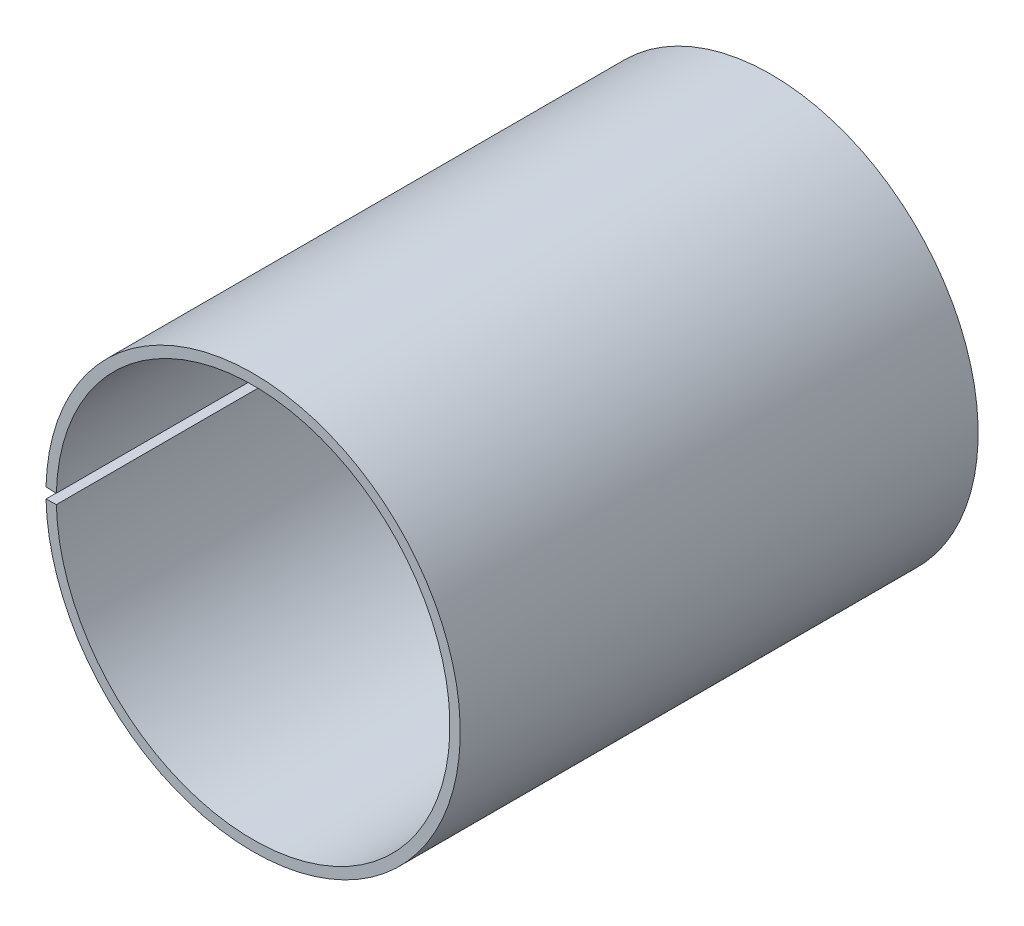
ISO-10303-21;
HEADER;
FILE_DESCRIPTION(('STEP AP214'),'2;1');
FILE_NAME('part.step','',(''),(''),'','','');
FILE_SCHEMA(('AUTOMOTIVE_DESIGN { 1 0 10303 214 1 1 1 1 }'));
ENDSEC;
DATA;
#1=APPLICATION_CONTEXT('core data for automotive mechanical design processes');
#2=APPLICATION_PROTOCOL_DEFINITION('international standard','automotive_design',2000,#1);
#3=PRODUCT_CONTEXT('',#1,'mechanical');
#4=PRODUCT('Part','Part','',(#3));
#5=PRODUCT_RELATED_PRODUCT_CATEGORY('part','',(#4));
#6=PRODUCT_DEFINITION_FORMATION('','',#4);
#7=PRODUCT_DEFINITION_CONTEXT('part definition',#1,'design');
#8=PRODUCT_DEFINITION('design','',#6,#7);
#9=PRODUCT_DEFINITION_SHAPE('','',#8);
#10=(LENGTH_UNIT() NAMED_UNIT(*) SI_UNIT(.MILLI.,.METRE.));
#11=(NAMED_UNIT(*) PLANE_ANGLE_UNIT() SI_UNIT($,.RADIAN.));
#12=(NAMED_UNIT(*) SI_UNIT($,.STERADIAN.) SOLID_ANGLE_UNIT());
#13=UNCERTAINTY_MEASURE_WITH_UNIT(LENGTH_MEASURE(1.E-05),#10,'distance_accuracy_value','');
#14=(GEOMETRIC_REPRESENTATION_CONTEXT(3) GLOBAL_UNCERTAINTY_ASSIGNED_CONTEXT((#13)) GLOBAL_UNIT_ASSIGNED_CONTEXT((#10,
#11,#12)) REPRESENTATION_CONTEXT('',''));
#15=CARTESIAN_POINT('',(0.,0.,0.));
#16=DIRECTION('',(0.,0.,1.));
#17=DIRECTION('',(1.,0.,0.));
#18=AXIS2_PLACEMENT_3D('',#15,#16,#17);
#19=CARTESIAN_POINT('',(100.,0.,-100.));
#20=DIRECTION('',(0.,0.,1.));
#21=DIRECTION('',(1.,0.,0.));
#22=AXIS2_PLACEMENT_3D('',#19,#20,#21);
#23=CYLINDRICAL_SURFACE('',#22,40.);
#24=CARTESIAN_POINT('',(100.,0.,0.));
#25=DIRECTION('',(0.,0.,1.));
#26=DIRECTION('',(1.,0.,0.));
#27=AXIS2_PLACEMENT_3D('',#24,#25,#26);
#28=CIRCLE('',#27,40.);
#29=CARTESIAN_POINT('',(60.0125019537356,-1.00000000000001,0.));
#30=VERTEX_POINT('',#29);
#31=CARTESIAN_POINT('',(60.0125019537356,1.00000000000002,0.));
#32=VERTEX_POINT('',#31);
#33=EDGE_CURVE('E100',#30,#32,#28,.T.);
#34=ORIENTED_EDGE('',*,*,#33,.F.);
#35=DIRECTION('',(0.,0.,1.));
#36=VECTOR('',#35,1.);
#37=CARTESIAN_POINT('',(60.0125019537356,-1.00000000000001,-100.));
#38=LINE('',#37,#36);
#39=CARTESIAN_POINT('',(60.0125019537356,-1.00000000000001,-100.));
#40=VERTEX_POINT('',#39);
#41=EDGE_CURVE('E11',#40,#30,#38,.T.);
#42=ORIENTED_EDGE('',*,*,#41,.F.);
#43=CARTESIAN_POINT('',(100.,0.,-100.));
#44=DIRECTION('',(0.,0.,1.));
#45=DIRECTION('',(1.,0.,0.));
#46=AXIS2_PLACEMENT_3D('',#43,#44,#45);
#47=CIRCLE('',#46,40.);
#48=CARTESIAN_POINT('',(60.0125019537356,1.00000000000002,-100.));
#49=VERTEX_POINT('',#48);
#50=EDGE_CURVE('E95',#40,#49,#47,.T.);
#51=ORIENTED_EDGE('',*,*,#50,.T.);
#52=DIRECTION('',(0.,0.,1.));
#53=VECTOR('',#52,1.);
#54=CARTESIAN_POINT('',(60.0125019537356,1.00000000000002,-100.));
#55=LINE('',#54,#53);
#56=EDGE_CURVE('E38',#49,#32,#55,.T.);
#57=ORIENTED_EDGE('',*,*,#56,.T.);
#58=EDGE_LOOP('',(#34,#42,#51,#57));
#59=FACE_BOUND('',#58,.T.);
#60=ADVANCED_FACE('F35',(#59),#23,.T.);
#61=CARTESIAN_POINT('',(60.0125019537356,-1.00000000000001,-100.));
#62=DIRECTION('',(0.0250000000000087,-0.99968745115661,0.));
#63=DIRECTION('',(0.99968745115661,0.0250000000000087,0.));
#64=AXIS2_PLACEMENT_3D('',#61,#62,#63);
#65=PLANE('',#64);
#66=DIRECTION('',(0.99968745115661,0.0250000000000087,0.));
#67=VECTOR('',#66,1.);
#68=CARTESIAN_POINT('',(60.0125019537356,-1.00000000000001,0.));
#69=LINE('',#68,#67);
#70=CARTESIAN_POINT('',(62.0118768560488,-0.949999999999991,0.));
#71=VERTEX_POINT('',#70);
#72=EDGE_CURVE('E68',#30,#71,#69,.T.);
#73=ORIENTED_EDGE('',*,*,#72,.T.);
#74=DIRECTION('',(0.,0.,1.));
#75=VECTOR('',#74,1.);
#76=CARTESIAN_POINT('',(62.0118768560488,-0.949999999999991,-100.));
#77=LINE('',#76,#75);
#78=CARTESIAN_POINT('',(62.0118768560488,-0.949999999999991,-100.));
#79=VERTEX_POINT('',#78);
#80=EDGE_CURVE('E44',#79,#71,#77,.T.);
#81=ORIENTED_EDGE('',*,*,#80,.F.);
#82=DIRECTION('',(0.99968745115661,0.0250000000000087,0.));
#83=VECTOR('',#82,1.);
#84=CARTESIAN_POINT('',(60.0125019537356,-1.00000000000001,-100.));
#85=LINE('',#84,#83);
#86=EDGE_CURVE('E83',#40,#79,#85,.T.);
#87=ORIENTED_EDGE('',*,*,#86,.F.);
#88=ORIENTED_EDGE('',*,*,#41,.T.);
#89=EDGE_LOOP('',(#73,#81,#87,#88));
#90=FACE_BOUND('',#89,.T.);
#91=ADVANCED_FACE('F110',(#90),#65,.F.);
#92=CARTESIAN_POINT('',(100.,0.,-100.));
#93=DIRECTION('',(0.,0.,1.));
#94=DIRECTION('',(1.,0.,0.));
#95=AXIS2_PLACEMENT_3D('',#92,#93,#94);
#96=CYLINDRICAL_SURFACE('',#95,38.);
#97=CARTESIAN_POINT('',(100.,0.,0.));
#98=DIRECTION('',(0.,0.,1.));
#99=DIRECTION('',(1.,0.,0.));
#100=AXIS2_PLACEMENT_3D('',#97,#98,#99);
#101=CIRCLE('',#100,38.);
#102=CARTESIAN_POINT('',(62.0118768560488,0.950000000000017,0.));
#103=VERTEX_POINT('',#102);
#104=EDGE_CURVE('E90',#71,#103,#101,.T.);
#105=ORIENTED_EDGE('',*,*,#104,.T.);
#106=DIRECTION('',(0.,0.,1.));
#107=VECTOR('',#106,1.);
#108=CARTESIAN_POINT('',(62.0118768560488,0.950000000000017,-100.));
#109=LINE('',#108,#107);
#110=CARTESIAN_POINT('',(62.0118768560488,0.950000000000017,-100.));
#111=VERTEX_POINT('',#110);
#112=EDGE_CURVE('E87',#111,#103,#109,.T.);
#113=ORIENTED_EDGE('',*,*,#112,.F.);
#114=CARTESIAN_POINT('',(100.,0.,-100.));
#115=DIRECTION('',(0.,0.,1.));
#116=DIRECTION('',(1.,0.,0.));
#117=AXIS2_PLACEMENT_3D('',#114,#115,#116);
#118=CIRCLE('',#117,38.);
#119=EDGE_CURVE('E80',#79,#111,#118,.T.);
#120=ORIENTED_EDGE('',*,*,#119,.F.);
#121=ORIENTED_EDGE('',*,*,#80,.T.);
#122=EDGE_LOOP('',(#105,#113,#120,#121));
#123=FACE_BOUND('',#122,.T.);
#124=ADVANCED_FACE('F88',(#123),#96,.F.);
#125=CARTESIAN_POINT('',(62.0118768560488,0.950000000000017,-100.));
#126=DIRECTION('',(0.0250000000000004,0.99968745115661,0.));
#127=DIRECTION('',(-0.99968745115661,0.0250000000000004,0.));
#128=AXIS2_PLACEMENT_3D('',#125,#126,#127);
#129=PLANE('',#128);
#130=DIRECTION('',(-0.99968745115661,0.0250000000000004,0.));
#131=VECTOR('',#130,1.);
#132=CARTESIAN_POINT('',(62.0118768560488,0.950000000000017,0.));
#133=LINE('',#132,#131);
#134=EDGE_CURVE('E103',#103,#32,#133,.T.);
#135=ORIENTED_EDGE('',*,*,#134,.T.);
#136=ORIENTED_EDGE('',*,*,#56,.F.);
#137=DIRECTION('',(-0.99968745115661,0.0250000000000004,0.));
#138=VECTOR('',#137,1.);
#139=CARTESIAN_POINT('',(62.0118768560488,0.950000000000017,-100.));
#140=LINE('',#139,#138);
#141=EDGE_CURVE('E77',#111,#49,#140,.T.);
#142=ORIENTED_EDGE('',*,*,#141,.F.);
#143=ORIENTED_EDGE('',*,*,#112,.T.);
#144=EDGE_LOOP('',(#135,#136,#142,#143));
#145=FACE_BOUND('',#144,.T.);
#146=ADVANCED_FACE('F94',(#145),#129,.F.);
#147=CARTESIAN_POINT('',(100.,0.,-100.));
#148=DIRECTION('',(0.,0.,1.));
#149=DIRECTION('',(1.,0.,0.));
#150=AXIS2_PLACEMENT_3D('',#147,#148,#149);
#151=PLANE('',#150);
#152=ORIENTED_EDGE('',*,*,#50,.F.);
#153=ORIENTED_EDGE('',*,*,#86,.T.);
#154=ORIENTED_EDGE('',*,*,#119,.T.);
#155=ORIENTED_EDGE('',*,*,#141,.T.);
#156=EDGE_LOOP('',(#152,#153,#154,#155));
#157=FACE_BOUND('',#156,.T.);
#158=ADVANCED_FACE('F82',(#157),#151,.F.);
#159=CARTESIAN_POINT('',(100.,0.,0.));
#160=DIRECTION('',(0.,0.,1.));
#161=DIRECTION('',(1.,0.,0.));
#162=AXIS2_PLACEMENT_3D('',#159,#160,#161);
#163=PLANE('',#162);
#164=ORIENTED_EDGE('',*,*,#33,.T.);
#165=ORIENTED_EDGE('',*,*,#134,.F.);
#166=ORIENTED_EDGE('',*,*,#104,.F.);
#167=ORIENTED_EDGE('',*,*,#72,.F.);
#168=EDGE_LOOP('',(#164,#165,#166,#167));
#169=FACE_BOUND('',#168,.T.);
#170=ADVANCED_FACE('F108',(#169),#163,.T.);
#171=CLOSED_SHELL('',(#60,#91,#124,#146,#158,#170));
#172=MANIFOLD_SOLID_BREP('B2',#171);
#173=ADVANCED_BREP_SHAPE_REPRESENTATION('',(#18,#172),#14);
#174=SHAPE_DEFINITION_REPRESENTATION(#9,#173);
ENDSEC;
END-ISO-10303-21;
